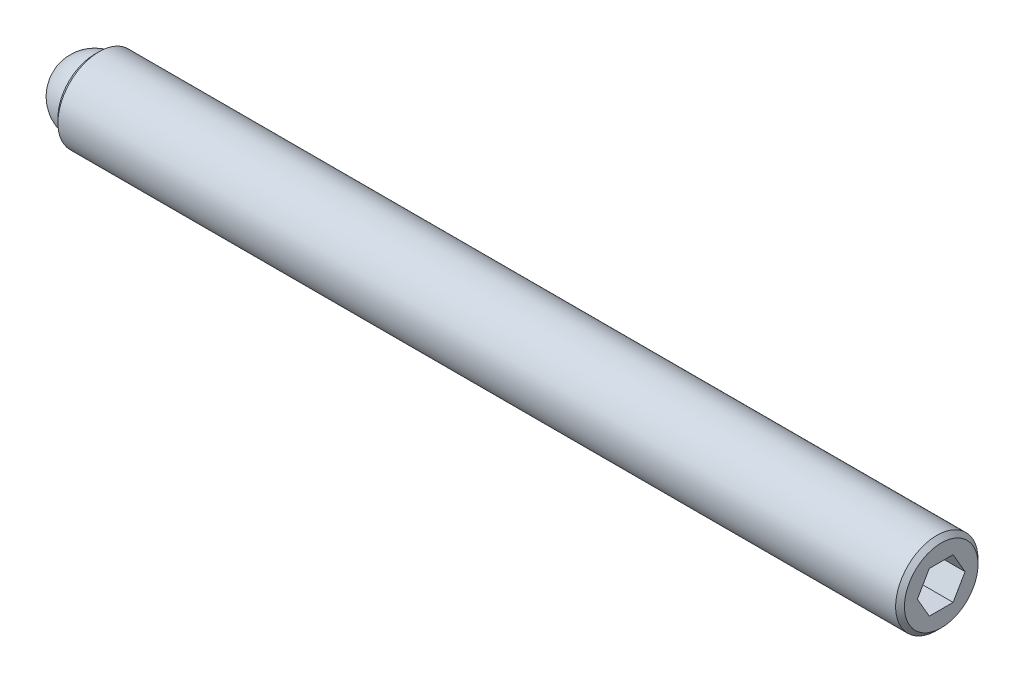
from build123d import *

# Parameters (mm, degrees)
SKETCH2_R           = 2.3749
BOSS_EXTRUDE1_DEPTH = 48.815625
CHAMFER1_SIZE       = 0.254
CHAMFER2_SIZE       = 0.254
CUT_EXTRUDE2_DEPTH  = 2.286
SKETCH3_R           = 1.9812
CUT_EXTRUDE3_DEPTH  = 1.984375


with BuildPart() as part:
    # Sketch2 → Boss-Extrude1 (new body)
    with BuildSketch(Plane(origin=(0, 0, 0), x_dir=(0, 0, -1), z_dir=(1, 0, 0))):
        Circle(SKETCH2_R)
    extrude(amount=BOSS_EXTRUDE1_DEPTH)

    # Chamfer1
    chamfer1_edges = [part.edges().sort_by_distance(p)[0] for p in [
        (0, 0, 2.3749),
    ]]
    chamfer(chamfer1_edges, length=CHAMFER1_SIZE)

    # Chamfer2
    chamfer2_edges = [part.edges().sort_by_distance(p)[0] for p in [
        (48.815625, 0, 2.3749),
    ]]
    chamfer(chamfer2_edges, length=CHAMFER2_SIZE)

    # Sketch4 → Cut-Extrude2 (cut)
    with BuildSketch(Plane(origin=(48.815625, 0, 0), x_dir=(0, 0, -1), z_dir=(1, 0, 0))):
        Polygon((1.374815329, 0), (0.687407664, 1.190625), (-0.687407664, 1.190625), (-1.374815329, 0), (-0.687407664, -1.190625), (0.687407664, -1.190625), align=None)
    extrude(amount=-CUT_EXTRUDE2_DEPTH, mode=Mode.SUBTRACT)

    # Sketch3 → Cut-Extrude3 (cut)
    with BuildSketch(Plane.ZY):
        Circle(SKETCH3_R)
    extrude(amount=-CUT_EXTRUDE3_DEPTH, mode=Mode.SUBTRACT)


with BuildPart() as body_2:
    # Sketch5 → Revolve1 (revolve)
    with BuildSketch(Plane.ZY):
        with BuildLine():
            Line((0, 0), (0, -1.984375))
            ThreePointArc((0, -1.984375), (-1.984375, 0), (0, 1.984375))
            Line((0, 1.984375), (0, 0))
        make_face()
    revolve(axis=Axis((0, 0, 0), (0, 1, 0)))


solid = Compound([part.part, body_2.part])
